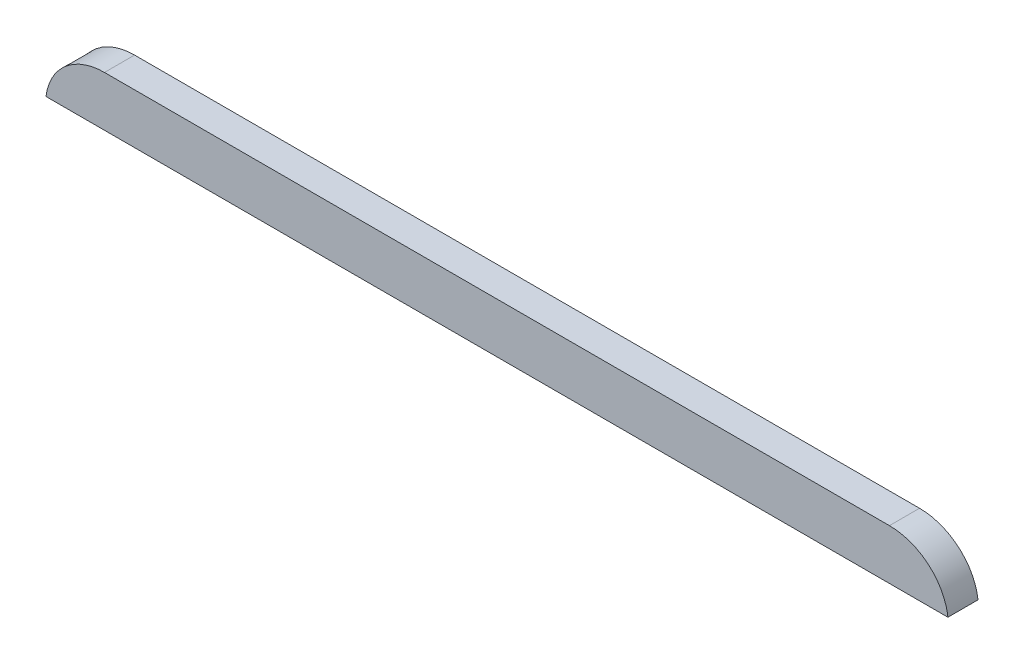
ISO-10303-21;
HEADER;
FILE_DESCRIPTION(('STEP AP214'),'2;1');
FILE_NAME('part.step','',(''),(''),'','','');
FILE_SCHEMA(('AUTOMOTIVE_DESIGN { 1 0 10303 214 1 1 1 1 }'));
ENDSEC;
DATA;
#1=APPLICATION_CONTEXT('core data for automotive mechanical design processes');
#2=APPLICATION_PROTOCOL_DEFINITION('international standard','automotive_design',2000,#1);
#3=PRODUCT_CONTEXT('',#1,'mechanical');
#4=PRODUCT('Part','Part','',(#3));
#5=PRODUCT_RELATED_PRODUCT_CATEGORY('part','',(#4));
#6=PRODUCT_DEFINITION_FORMATION('','',#4);
#7=PRODUCT_DEFINITION_CONTEXT('part definition',#1,'design');
#8=PRODUCT_DEFINITION('design','',#6,#7);
#9=PRODUCT_DEFINITION_SHAPE('','',#8);
#10=(LENGTH_UNIT() NAMED_UNIT(*) SI_UNIT(.MILLI.,.METRE.));
#11=(NAMED_UNIT(*) PLANE_ANGLE_UNIT() SI_UNIT($,.RADIAN.));
#12=(NAMED_UNIT(*) SI_UNIT($,.STERADIAN.) SOLID_ANGLE_UNIT());
#13=UNCERTAINTY_MEASURE_WITH_UNIT(LENGTH_MEASURE(1.E-05),#10,'distance_accuracy_value','');
#14=(GEOMETRIC_REPRESENTATION_CONTEXT(3) GLOBAL_UNCERTAINTY_ASSIGNED_CONTEXT((#13)) GLOBAL_UNIT_ASSIGNED_CONTEXT((#10,
#11,#12)) REPRESENTATION_CONTEXT('',''));
#15=CARTESIAN_POINT('',(0.,0.,0.));
#16=DIRECTION('',(0.,0.,1.));
#17=DIRECTION('',(1.,0.,0.));
#18=AXIS2_PLACEMENT_3D('',#15,#16,#17);
#19=CARTESIAN_POINT('',(344.698877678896,321.167332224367,23.));
#20=CARTESIAN_POINT('',(344.537602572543,322.50179030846,23.));
#21=CARTESIAN_POINT('',(344.313743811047,323.826814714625,23.));
#22=CARTESIAN_POINT('',(343.736941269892,326.457405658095,23.));
#23=CARTESIAN_POINT('',(343.382311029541,327.766486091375,23.));
#24=CARTESIAN_POINT('',(342.142483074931,331.59600742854,23.));
#25=CARTESIAN_POINT('',(341.078752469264,334.040203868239,23.));
#26=CARTESIAN_POINT('',(339.150362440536,337.553812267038,23.));
#27=CARTESIAN_POINT('',(338.450145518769,338.698670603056,23.));
#28=CARTESIAN_POINT('',(336.9340500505,340.935321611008,23.));
#29=CARTESIAN_POINT('',(336.128506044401,342.011861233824,23.));
#30=CARTESIAN_POINT('',(333.57401121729,345.115331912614,23.));
#31=CARTESIAN_POINT('',(331.688879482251,347.020064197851,23.));
#32=CARTESIAN_POINT('',(328.587582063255,349.629375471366,23.));
#33=CARTESIAN_POINT('',(327.516772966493,350.451605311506,23.));
#34=CARTESIAN_POINT('',(325.302015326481,351.998382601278,23.));
#35=CARTESIAN_POINT('',(324.168134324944,352.715953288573,23.));
#36=CARTESIAN_POINT('',(320.689717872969,354.706967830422,23.));
#37=CARTESIAN_POINT('',(318.268652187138,355.819226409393,23.));
#38=CARTESIAN_POINT('',(315.119727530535,356.951349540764,23.));
#39=CARTESIAN_POINT('',(314.483797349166,357.164831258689,23.));
#40=CARTESIAN_POINT('',(313.199321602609,357.565224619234,23.));
#41=CARTESIAN_POINT('',(312.549426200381,357.752447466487,23.));
#42=CARTESIAN_POINT('',(310.597248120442,358.268888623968,23.));
#43=CARTESIAN_POINT('',(309.288789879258,358.554318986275,23.));
#44=CARTESIAN_POINT('',(305.342850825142,359.237835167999,23.));
#45=CARTESIAN_POINT('',(302.684862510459,359.463623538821,23.));
#46=CARTESIAN_POINT('',(300.,359.463623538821,23.));
#47=B_SPLINE_CURVE_WITH_KNOTS('',3,(#19,#20,#21,#22,#23,#24,#25,#26,#27,#28,#29,#30,#31,#32,#33,
#34,#35,#36,#37,#38,#39,#40,#41,#42,#43,#44,#45,#46),.UNSPECIFIED.,.F.,.F.,(4,2,2,2,2,2,2,2,2,2,
2,2,2,4),(0.,0.062500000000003,0.125000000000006,0.250000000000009,0.312500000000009,
0.375000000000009,0.50000000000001,0.56250000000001,0.62500000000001,0.750000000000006,
0.781250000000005,0.812500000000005,0.875000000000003,1.),.UNSPECIFIED.);
#48=DIRECTION('',(0.,0.,-1.));
#49=VECTOR('',#48,1.);
#50=SURFACE_OF_LINEAR_EXTRUSION('',#47,#49);
#51=CARTESIAN_POINT('',(344.698877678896,321.167332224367,0.));
#52=CARTESIAN_POINT('',(344.537602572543,322.50179030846,0.));
#53=CARTESIAN_POINT('',(344.313743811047,323.826814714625,0.));
#54=CARTESIAN_POINT('',(343.736941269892,326.457405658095,0.));
#55=CARTESIAN_POINT('',(343.382311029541,327.766486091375,0.));
#56=CARTESIAN_POINT('',(342.142483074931,331.59600742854,0.));
#57=CARTESIAN_POINT('',(341.078752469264,334.040203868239,0.));
#58=CARTESIAN_POINT('',(339.150362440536,337.553812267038,0.));
#59=CARTESIAN_POINT('',(338.450145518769,338.698670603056,0.));
#60=CARTESIAN_POINT('',(336.9340500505,340.935321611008,0.));
#61=CARTESIAN_POINT('',(336.128506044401,342.011861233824,0.));
#62=CARTESIAN_POINT('',(333.57401121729,345.115331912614,0.));
#63=CARTESIAN_POINT('',(331.688879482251,347.020064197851,0.));
#64=CARTESIAN_POINT('',(328.587582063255,349.629375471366,0.));
#65=CARTESIAN_POINT('',(327.516772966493,350.451605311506,0.));
#66=CARTESIAN_POINT('',(325.302015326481,351.998382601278,0.));
#67=CARTESIAN_POINT('',(324.168134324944,352.715953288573,0.));
#68=CARTESIAN_POINT('',(320.689717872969,354.706967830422,0.));
#69=CARTESIAN_POINT('',(318.268652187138,355.819226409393,0.));
#70=CARTESIAN_POINT('',(315.119727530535,356.951349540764,0.));
#71=CARTESIAN_POINT('',(314.483797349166,357.164831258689,0.));
#72=CARTESIAN_POINT('',(313.199321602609,357.565224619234,0.));
#73=CARTESIAN_POINT('',(312.549426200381,357.752447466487,0.));
#74=CARTESIAN_POINT('',(310.597248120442,358.268888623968,0.));
#75=CARTESIAN_POINT('',(309.288789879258,358.554318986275,0.));
#76=CARTESIAN_POINT('',(305.342850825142,359.237835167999,0.));
#77=CARTESIAN_POINT('',(302.684862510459,359.463623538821,0.));
#78=CARTESIAN_POINT('',(300.,359.463623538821,0.));
#79=B_SPLINE_CURVE_WITH_KNOTS('',3,(#51,#52,#53,#54,#55,#56,#57,#58,#59,#60,#61,#62,#63,#64,#65,
#66,#67,#68,#69,#70,#71,#72,#73,#74,#75,#76,#77,#78),.UNSPECIFIED.,.F.,.F.,(4,2,2,2,2,2,2,2,2,2,
2,2,2,4),(0.,0.062500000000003,0.125000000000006,0.250000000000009,0.312500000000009,
0.375000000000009,0.50000000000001,0.56250000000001,0.62500000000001,0.750000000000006,
0.781250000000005,0.812500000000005,0.875000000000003,1.),.UNSPECIFIED.);
#80=CARTESIAN_POINT('',(344.698877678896,321.167332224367,0.));
#81=VERTEX_POINT('',#80);
#82=CARTESIAN_POINT('',(300.,359.463623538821,0.));
#83=VERTEX_POINT('',#82);
#84=EDGE_CURVE('E190',#81,#83,#79,.T.);
#85=ORIENTED_EDGE('',*,*,#84,.T.);
#86=DIRECTION('',(0.,0.,-1.));
#87=VECTOR('',#86,1.);
#88=CARTESIAN_POINT('',(300.,359.463623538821,23.));
#89=LINE('',#88,#87);
#90=CARTESIAN_POINT('',(300.,359.463623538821,23.));
#91=VERTEX_POINT('',#90);
#92=EDGE_CURVE('E11',#91,#83,#89,.T.);
#93=ORIENTED_EDGE('',*,*,#92,.F.);
#94=CARTESIAN_POINT('',(300.,359.463623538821,23.));
#95=CARTESIAN_POINT('',(302.684862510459,359.463623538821,23.));
#96=CARTESIAN_POINT('',(305.342850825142,359.237835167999,23.));
#97=CARTESIAN_POINT('',(309.288789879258,358.554318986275,23.));
#98=CARTESIAN_POINT('',(310.597248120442,358.268888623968,23.));
#99=CARTESIAN_POINT('',(312.549426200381,357.752447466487,23.));
#100=CARTESIAN_POINT('',(313.199321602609,357.565224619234,23.));
#101=CARTESIAN_POINT('',(314.483797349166,357.164831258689,23.));
#102=CARTESIAN_POINT('',(315.119727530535,356.951349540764,23.));
#103=CARTESIAN_POINT('',(318.268652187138,355.819226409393,23.));
#104=CARTESIAN_POINT('',(320.689717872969,354.706967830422,23.));
#105=CARTESIAN_POINT('',(324.168134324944,352.715953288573,23.));
#106=CARTESIAN_POINT('',(325.302015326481,351.998382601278,23.));
#107=CARTESIAN_POINT('',(327.516772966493,350.451605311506,23.));
#108=CARTESIAN_POINT('',(328.587582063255,349.629375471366,23.));
#109=CARTESIAN_POINT('',(331.688879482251,347.020064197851,23.));
#110=CARTESIAN_POINT('',(333.57401121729,345.115331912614,23.));
#111=CARTESIAN_POINT('',(336.128506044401,342.011861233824,23.));
#112=CARTESIAN_POINT('',(336.9340500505,340.935321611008,23.));
#113=CARTESIAN_POINT('',(338.450145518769,338.698670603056,23.));
#114=CARTESIAN_POINT('',(339.150362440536,337.553812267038,23.));
#115=CARTESIAN_POINT('',(341.078752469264,334.040203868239,23.));
#116=CARTESIAN_POINT('',(342.142483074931,331.59600742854,23.));
#117=CARTESIAN_POINT('',(343.382311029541,327.766486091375,23.));
#118=CARTESIAN_POINT('',(343.736941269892,326.457405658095,23.));
#119=CARTESIAN_POINT('',(344.313743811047,323.826814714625,23.));
#120=CARTESIAN_POINT('',(344.537602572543,322.50179030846,23.));
#121=CARTESIAN_POINT('',(344.698877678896,321.167332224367,23.));
#122=B_SPLINE_CURVE_WITH_KNOTS('',3,(#94,#95,#96,#97,#98,#99,#100,#101,#102,#103,#104,#105,#106,
#107,#108,#109,#110,#111,#112,#113,#114,#115,#116,#117,#118,#119,#120,#121),.UNSPECIFIED.,.F.,
.F.,(4,2,2,2,2,2,2,2,2,2,2,2,2,4),(0.,0.124999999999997,0.187499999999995,0.218749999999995,
0.249999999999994,0.37499999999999,0.43749999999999,0.49999999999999,0.624999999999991,
0.687499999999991,0.749999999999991,0.874999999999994,0.937499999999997,1.),.UNSPECIFIED.);
#123=CARTESIAN_POINT('',(344.698877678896,321.167332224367,23.));
#124=VERTEX_POINT('',#123);
#125=EDGE_CURVE('E91',#124,#91,#122,.F.);
#126=ORIENTED_EDGE('',*,*,#125,.F.);
#127=DIRECTION('',(0.,0.,-1.));
#128=VECTOR('',#127,1.);
#129=CARTESIAN_POINT('',(344.698877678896,321.167332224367,23.));
#130=LINE('',#129,#128);
#131=EDGE_CURVE('E176',#124,#81,#130,.T.);
#132=ORIENTED_EDGE('',*,*,#131,.T.);
#133=EDGE_LOOP('',(#85,#93,#126,#132));
#134=FACE_BOUND('',#133,.T.);
#135=ADVANCED_FACE('F32',(#134),#50,.F.);
#136=CARTESIAN_POINT('',(-300.,359.463623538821,23.));
#137=DIRECTION('',(0.,-1.,0.));
#138=DIRECTION('',(0.,0.,-1.));
#139=AXIS2_PLACEMENT_3D('',#136,#137,#138);
#140=PLANE('',#139);
#141=DIRECTION('',(-1.,0.,0.));
#142=VECTOR('',#141,1.);
#143=CARTESIAN_POINT('',(-300.,359.463623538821,0.));
#144=LINE('',#143,#142);
#145=CARTESIAN_POINT('',(-300.,359.463623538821,0.));
#146=VERTEX_POINT('',#145);
#147=EDGE_CURVE('E96',#83,#146,#144,.T.);
#148=ORIENTED_EDGE('',*,*,#147,.T.);
#149=DIRECTION('',(0.,0.,-1.));
#150=VECTOR('',#149,1.);
#151=CARTESIAN_POINT('',(-300.,359.463623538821,23.));
#152=LINE('',#151,#150);
#153=CARTESIAN_POINT('',(-300.,359.463623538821,23.));
#154=VERTEX_POINT('',#153);
#155=EDGE_CURVE('E45',#154,#146,#152,.T.);
#156=ORIENTED_EDGE('',*,*,#155,.F.);
#157=DIRECTION('',(-1.,0.,0.));
#158=VECTOR('',#157,1.);
#159=CARTESIAN_POINT('',(-300.,359.463623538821,23.));
#160=LINE('',#159,#158);
#161=EDGE_CURVE('E85',#91,#154,#160,.T.);
#162=ORIENTED_EDGE('',*,*,#161,.F.);
#163=ORIENTED_EDGE('',*,*,#92,.T.);
#164=EDGE_LOOP('',(#148,#156,#162,#163));
#165=FACE_BOUND('',#164,.T.);
#166=ADVANCED_FACE('F95',(#165),#140,.F.);
#167=CARTESIAN_POINT('',(-300.,359.463623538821,23.));
#168=CARTESIAN_POINT('',(-302.660461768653,359.463623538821,23.));
#169=CARTESIAN_POINT('',(-305.294421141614,359.241908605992,23.));
#170=CARTESIAN_POINT('',(-309.20490788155,358.570918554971,23.));
#171=CARTESIAN_POINT('',(-310.501647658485,358.290737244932,23.));
#172=CARTESIAN_POINT('',(-313.081324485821,357.614903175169,23.));
#173=CARTESIAN_POINT('',(-314.366250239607,357.218537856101,23.));
#174=CARTESIAN_POINT('',(-316.913486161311,356.309846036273,23.));
#175=CARTESIAN_POINT('',(-318.163441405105,355.802203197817,23.));
#176=CARTESIAN_POINT('',(-320.00209126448,354.959016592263,23.));
#177=CARTESIAN_POINT('',(-320.608923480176,354.66432520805,23.));
#178=CARTESIAN_POINT('',(-321.810305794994,354.047278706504,23.));
#179=CARTESIAN_POINT('',(-322.405856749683,353.724314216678,23.));
#180=CARTESIAN_POINT('',(-325.333022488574,352.050560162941,23.));
#181=CARTESIAN_POINT('',(-327.523007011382,350.519609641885,23.));
#182=CARTESIAN_POINT('',(-330.589898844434,347.947326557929,23.));
#183=CARTESIAN_POINT('',(-331.575374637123,347.043323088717,23.));
#184=CARTESIAN_POINT('',(-333.469285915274,345.137867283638,23.));
#185=CARTESIAN_POINT('',(-334.380582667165,344.132523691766,23.));
#186=CARTESIAN_POINT('',(-336.098944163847,342.050552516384,23.));
#187=CARTESIAN_POINT('',(-336.907731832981,340.971572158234,23.));
#188=CARTESIAN_POINT('',(-338.045775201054,339.296449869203,23.));
#189=CARTESIAN_POINT('',(-338.413187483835,338.727554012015,23.));
#190=CARTESIAN_POINT('',(-339.119205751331,337.575695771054,23.));
#191=CARTESIAN_POINT('',(-339.457336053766,336.99363577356,23.));
#192=CARTESIAN_POINT('',(-341.073715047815,334.052731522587,23.));
#193=CARTESIAN_POINT('',(-342.138090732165,331.605760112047,23.));
#194=CARTESIAN_POINT('',(-343.37609963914,327.787559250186,23.));
#195=CARTESIAN_POINT('',(-343.729022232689,326.489581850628,23.));
#196=CARTESIAN_POINT('',(-344.310611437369,323.844965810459,23.));
#197=CARTESIAN_POINT('',(-344.53642196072,322.511559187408,23.));
#198=CARTESIAN_POINT('',(-344.698877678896,321.167332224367,23.));
#199=B_SPLINE_CURVE_WITH_KNOTS('',3,(#167,#168,#169,#170,#171,#172,#173,#174,#175,#176,#177,
#178,#179,#180,#181,#182,#183,#184,#185,#186,#187,#188,#189,#190,#191,#192,#193,#194,#195,#196,
#197,#198),.UNSPECIFIED.,.F.,.F.,(4,2,2,2,2,2,2,2,2,2,2,2,2,2,2,4),(0.,0.125000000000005,
0.187500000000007,0.25000000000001,0.312500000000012,0.343750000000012,0.375000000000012,
0.500000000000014,0.562500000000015,0.625000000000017,0.687500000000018,0.718750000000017,
0.750000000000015,0.875000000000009,0.937500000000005,1.),.UNSPECIFIED.);
#200=DIRECTION('',(0.,0.,-1.));
#201=VECTOR('',#200,1.);
#202=SURFACE_OF_LINEAR_EXTRUSION('',#199,#201);
#203=CARTESIAN_POINT('',(-300.,359.463623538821,0.));
#204=CARTESIAN_POINT('',(-302.660461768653,359.463623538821,0.));
#205=CARTESIAN_POINT('',(-305.294421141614,359.241908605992,0.));
#206=CARTESIAN_POINT('',(-309.20490788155,358.570918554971,0.));
#207=CARTESIAN_POINT('',(-310.501647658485,358.290737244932,0.));
#208=CARTESIAN_POINT('',(-313.081324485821,357.614903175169,0.));
#209=CARTESIAN_POINT('',(-314.366250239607,357.218537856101,0.));
#210=CARTESIAN_POINT('',(-316.913486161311,356.309846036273,0.));
#211=CARTESIAN_POINT('',(-318.163441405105,355.802203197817,0.));
#212=CARTESIAN_POINT('',(-320.00209126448,354.959016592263,0.));
#213=CARTESIAN_POINT('',(-320.608923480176,354.66432520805,0.));
#214=CARTESIAN_POINT('',(-321.810305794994,354.047278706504,0.));
#215=CARTESIAN_POINT('',(-322.405856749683,353.724314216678,0.));
#216=CARTESIAN_POINT('',(-325.333022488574,352.050560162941,0.));
#217=CARTESIAN_POINT('',(-327.523007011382,350.519609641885,0.));
#218=CARTESIAN_POINT('',(-330.589898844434,347.947326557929,0.));
#219=CARTESIAN_POINT('',(-331.575374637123,347.043323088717,0.));
#220=CARTESIAN_POINT('',(-333.469285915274,345.137867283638,0.));
#221=CARTESIAN_POINT('',(-334.380582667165,344.132523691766,0.));
#222=CARTESIAN_POINT('',(-336.098944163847,342.050552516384,0.));
#223=CARTESIAN_POINT('',(-336.907731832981,340.971572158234,0.));
#224=CARTESIAN_POINT('',(-338.045775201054,339.296449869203,0.));
#225=CARTESIAN_POINT('',(-338.413187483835,338.727554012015,0.));
#226=CARTESIAN_POINT('',(-339.119205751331,337.575695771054,0.));
#227=CARTESIAN_POINT('',(-339.457336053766,336.99363577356,0.));
#228=CARTESIAN_POINT('',(-341.073715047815,334.052731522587,0.));
#229=CARTESIAN_POINT('',(-342.138090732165,331.605760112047,0.));
#230=CARTESIAN_POINT('',(-343.37609963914,327.787559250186,0.));
#231=CARTESIAN_POINT('',(-343.729022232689,326.489581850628,0.));
#232=CARTESIAN_POINT('',(-344.310611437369,323.844965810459,0.));
#233=CARTESIAN_POINT('',(-344.53642196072,322.511559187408,0.));
#234=CARTESIAN_POINT('',(-344.698877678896,321.167332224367,0.));
#235=B_SPLINE_CURVE_WITH_KNOTS('',3,(#203,#204,#205,#206,#207,#208,#209,#210,#211,#212,#213,
#214,#215,#216,#217,#218,#219,#220,#221,#222,#223,#224,#225,#226,#227,#228,#229,#230,#231,#232,
#233,#234),.UNSPECIFIED.,.F.,.F.,(4,2,2,2,2,2,2,2,2,2,2,2,2,2,2,4),(0.,0.125000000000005,
0.187500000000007,0.25000000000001,0.312500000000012,0.343750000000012,0.375000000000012,
0.500000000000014,0.562500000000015,0.625000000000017,0.687500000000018,0.718750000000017,
0.750000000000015,0.875000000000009,0.937500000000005,1.),.UNSPECIFIED.);
#236=CARTESIAN_POINT('',(-344.698877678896,321.167332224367,0.));
#237=VERTEX_POINT('',#236);
#238=EDGE_CURVE('E71',#146,#237,#235,.T.);
#239=ORIENTED_EDGE('',*,*,#238,.T.);
#240=DIRECTION('',(0.,0.,-1.));
#241=VECTOR('',#240,1.);
#242=CARTESIAN_POINT('',(-344.698877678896,321.167332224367,23.));
#243=LINE('',#242,#241);
#244=CARTESIAN_POINT('',(-344.698877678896,321.167332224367,23.));
#245=VERTEX_POINT('',#244);
#246=EDGE_CURVE('E97',#245,#237,#243,.T.);
#247=ORIENTED_EDGE('',*,*,#246,.F.);
#248=CARTESIAN_POINT('',(-344.698877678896,321.167332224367,23.));
#249=CARTESIAN_POINT('',(-344.53642196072,322.511559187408,23.));
#250=CARTESIAN_POINT('',(-344.310611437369,323.844965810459,23.));
#251=CARTESIAN_POINT('',(-343.729022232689,326.489581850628,23.));
#252=CARTESIAN_POINT('',(-343.37609963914,327.787559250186,23.));
#253=CARTESIAN_POINT('',(-342.138090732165,331.605760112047,23.));
#254=CARTESIAN_POINT('',(-341.073715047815,334.052731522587,23.));
#255=CARTESIAN_POINT('',(-339.457336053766,336.99363577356,23.));
#256=CARTESIAN_POINT('',(-339.119205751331,337.575695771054,23.));
#257=CARTESIAN_POINT('',(-338.413187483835,338.727554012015,23.));
#258=CARTESIAN_POINT('',(-338.045775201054,339.296449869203,23.));
#259=CARTESIAN_POINT('',(-336.907731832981,340.971572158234,23.));
#260=CARTESIAN_POINT('',(-336.098944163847,342.050552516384,23.));
#261=CARTESIAN_POINT('',(-334.380582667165,344.132523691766,23.));
#262=CARTESIAN_POINT('',(-333.469285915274,345.137867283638,23.));
#263=CARTESIAN_POINT('',(-331.575374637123,347.043323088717,23.));
#264=CARTESIAN_POINT('',(-330.589898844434,347.947326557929,23.));
#265=CARTESIAN_POINT('',(-327.523007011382,350.519609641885,23.));
#266=CARTESIAN_POINT('',(-325.333022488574,352.050560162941,23.));
#267=CARTESIAN_POINT('',(-322.405856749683,353.724314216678,23.));
#268=CARTESIAN_POINT('',(-321.810305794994,354.047278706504,23.));
#269=CARTESIAN_POINT('',(-320.608923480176,354.66432520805,23.));
#270=CARTESIAN_POINT('',(-320.00209126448,354.959016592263,23.));
#271=CARTESIAN_POINT('',(-318.163441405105,355.802203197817,23.));
#272=CARTESIAN_POINT('',(-316.913486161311,356.309846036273,23.));
#273=CARTESIAN_POINT('',(-314.366250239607,357.218537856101,23.));
#274=CARTESIAN_POINT('',(-313.081324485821,357.614903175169,23.));
#275=CARTESIAN_POINT('',(-310.501647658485,358.290737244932,23.));
#276=CARTESIAN_POINT('',(-309.20490788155,358.570918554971,23.));
#277=CARTESIAN_POINT('',(-305.294421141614,359.241908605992,23.));
#278=CARTESIAN_POINT('',(-302.660461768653,359.463623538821,23.));
#279=CARTESIAN_POINT('',(-300.,359.463623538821,23.));
#280=B_SPLINE_CURVE_WITH_KNOTS('',3,(#248,#249,#250,#251,#252,#253,#254,#255,#256,#257,#258,
#259,#260,#261,#262,#263,#264,#265,#266,#267,#268,#269,#270,#271,#272,#273,#274,#275,#276,#277,
#278,#279),.UNSPECIFIED.,.F.,.F.,(4,2,2,2,2,2,2,2,2,2,2,2,2,2,2,4),(0.,0.0624999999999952,
0.124999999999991,0.249999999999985,0.281249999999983,0.312499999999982,0.374999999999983,
0.437499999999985,0.499999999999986,0.624999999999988,0.656249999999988,0.687499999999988,
0.74999999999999,0.812499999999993,0.874999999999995,1.),.UNSPECIFIED.);
#281=EDGE_CURVE('E88',#154,#245,#280,.F.);
#282=ORIENTED_EDGE('',*,*,#281,.F.);
#283=ORIENTED_EDGE('',*,*,#155,.T.);
#284=EDGE_LOOP('',(#239,#247,#282,#283));
#285=FACE_BOUND('',#284,.T.);
#286=ADVANCED_FACE('F100',(#285),#202,.F.);
#287=CARTESIAN_POINT('',(-344.698877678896,321.167332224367,23.));
#288=DIRECTION('',(0.,1.,0.));
#289=DIRECTION('',(-1.,0.,0.));
#290=AXIS2_PLACEMENT_3D('',#287,#288,#289);
#291=PLANE('',#290);
#292=DIRECTION('',(1.,0.,0.));
#293=VECTOR('',#292,1.);
#294=CARTESIAN_POINT('',(-344.698877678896,321.167332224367,0.));
#295=LINE('',#294,#293);
#296=EDGE_CURVE('E78',#237,#81,#295,.T.);
#297=ORIENTED_EDGE('',*,*,#296,.T.);
#298=ORIENTED_EDGE('',*,*,#131,.F.);
#299=DIRECTION('',(1.,0.,0.));
#300=VECTOR('',#299,1.);
#301=CARTESIAN_POINT('',(-344.698877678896,321.167332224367,23.));
#302=LINE('',#301,#300);
#303=EDGE_CURVE('E54',#245,#124,#302,.T.);
#304=ORIENTED_EDGE('',*,*,#303,.F.);
#305=ORIENTED_EDGE('',*,*,#246,.T.);
#306=EDGE_LOOP('',(#297,#298,#304,#305));
#307=FACE_BOUND('',#306,.T.);
#308=ADVANCED_FACE('F119',(#307),#291,.F.);
#309=CARTESIAN_POINT('',(329.621347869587,348.75960504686,23.));
#310=DIRECTION('',(0.,0.,1.));
#311=DIRECTION('',(1.,0.,0.));
#312=AXIS2_PLACEMENT_3D('',#309,#310,#311);
#313=PLANE('',#312);
#314=ORIENTED_EDGE('',*,*,#125,.T.);
#315=ORIENTED_EDGE('',*,*,#161,.T.);
#316=ORIENTED_EDGE('',*,*,#281,.T.);
#317=ORIENTED_EDGE('',*,*,#303,.T.);
#318=EDGE_LOOP('',(#314,#315,#316,#317));
#319=FACE_BOUND('',#318,.T.);
#320=ADVANCED_FACE('F86',(#319),#313,.T.);
#321=CARTESIAN_POINT('',(329.621347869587,348.75960504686,0.));
#322=DIRECTION('',(0.,0.,1.));
#323=DIRECTION('',(1.,0.,0.));
#324=AXIS2_PLACEMENT_3D('',#321,#322,#323);
#325=PLANE('',#324);
#326=ORIENTED_EDGE('',*,*,#84,.F.);
#327=ORIENTED_EDGE('',*,*,#296,.F.);
#328=ORIENTED_EDGE('',*,*,#238,.F.);
#329=ORIENTED_EDGE('',*,*,#147,.F.);
#330=EDGE_LOOP('',(#326,#327,#328,#329));
#331=FACE_BOUND('',#330,.T.);
#332=ADVANCED_FACE('F149',(#331),#325,.F.);
#333=CLOSED_SHELL('',(#135,#166,#286,#308,#320,#332));
#334=MANIFOLD_SOLID_BREP('B2',#333);
#335=ADVANCED_BREP_SHAPE_REPRESENTATION('',(#18,#334),#14);
#336=SHAPE_DEFINITION_REPRESENTATION(#9,#335);
ENDSEC;
END-ISO-10303-21;
